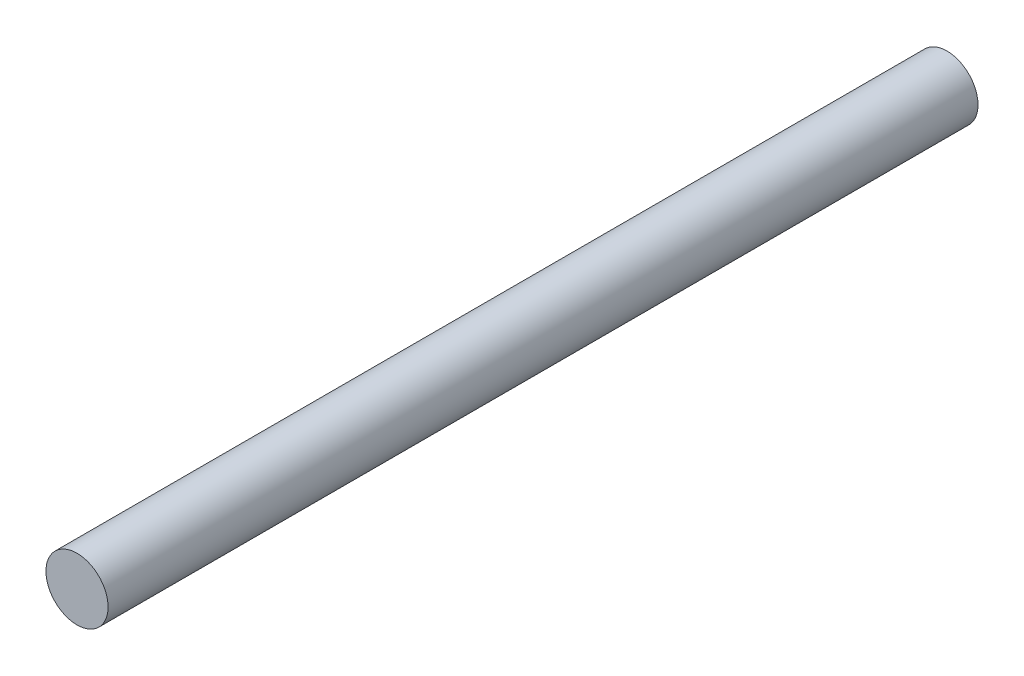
from build123d import *

# Parameters (mm, degrees)
SKETCH1_R           = 3.175
BOSS_EXTRUDE1_DEPTH = 88.9


with BuildPart() as part:
    # Sketch1 → Boss-Extrude1 (new body)
    with BuildSketch(Plane.XY):
        with Locations((52.7685, 0)):
            Circle(SKETCH1_R)
    extrude(amount=BOSS_EXTRUDE1_DEPTH)


solid = part.part
